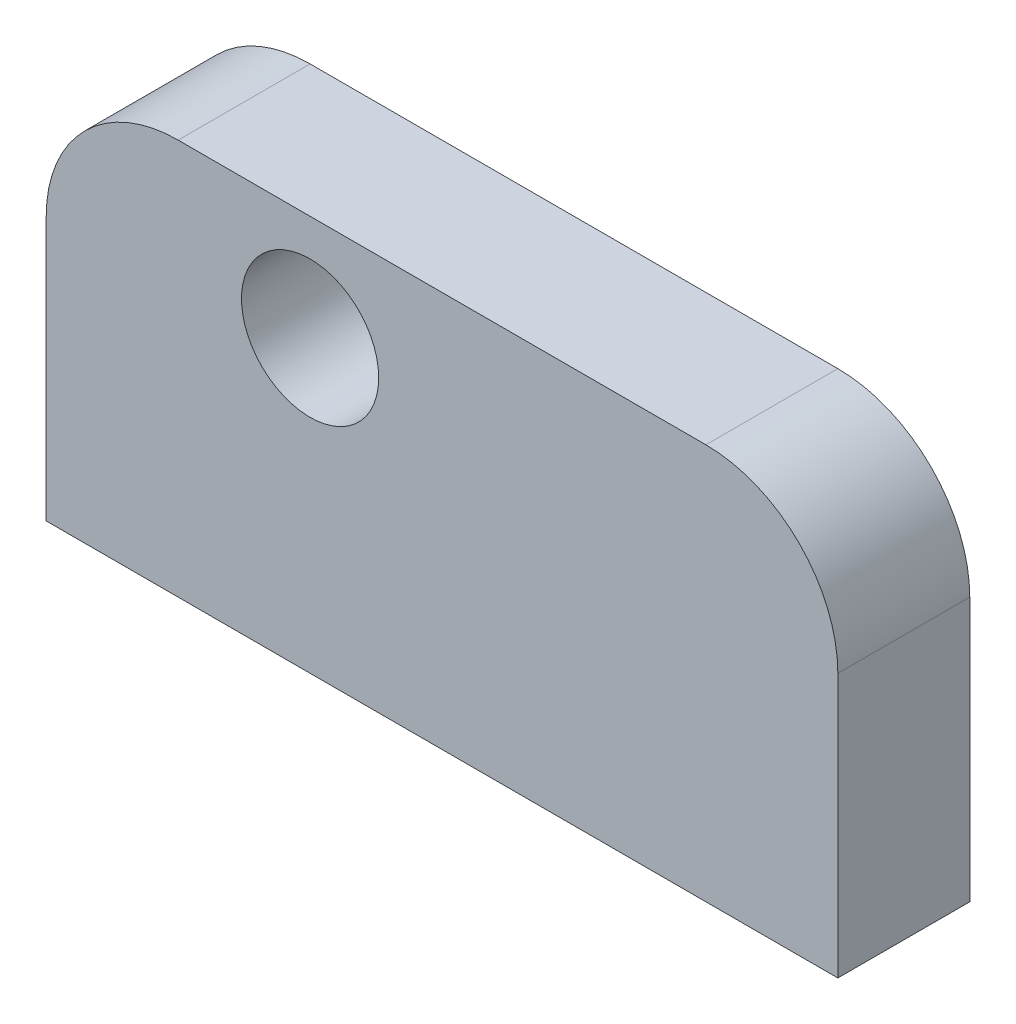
from build123d import *

# Parameters (mm, degrees)
SKETCH1_W           = 38.1
SKETCH1_H           = 19.05
SKETCH1_R           = 3.302
BOSS_EXTRUDE1_DEPTH = 6.35
FILLET1_R           = 6.35


with BuildPart() as part:
    # Sketch1 → Boss-Extrude1 (new body)
    with BuildSketch(Plane.XY):
        with Locations((36.068, -47.498)):
            Rectangle(SKETCH1_W, SKETCH1_H)
        with Locations((29.718, -43.053)):
            Circle(SKETCH1_R, mode=Mode.SUBTRACT)
    extrude(amount=BOSS_EXTRUDE1_DEPTH)

    # Fillet1
    fillet1_edges = [part.edges().sort_by_distance(p)[0] for p in [
        (17.018, -37.973, 3.175),
        (55.118, -37.973, 3.175),
    ]]
    fillet(fillet1_edges, radius=FILLET1_R)


solid = part.part
